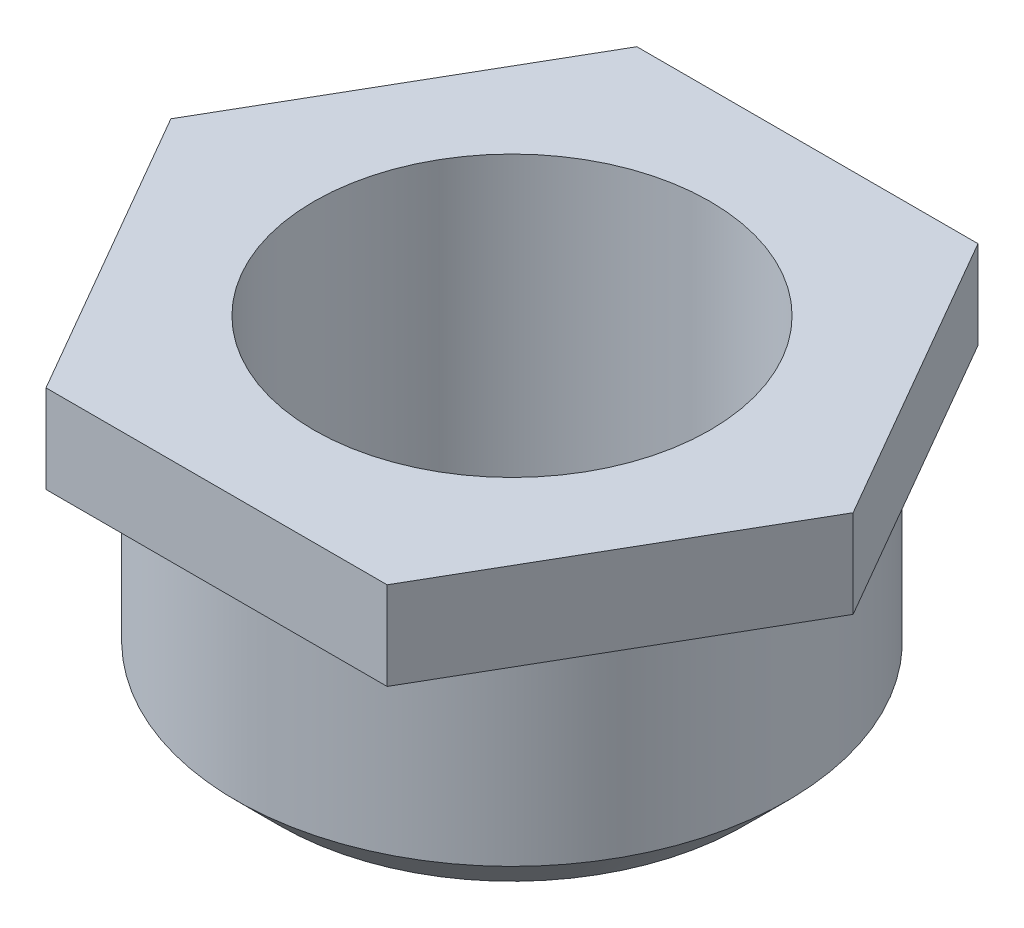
ISO-10303-21;
HEADER;
FILE_DESCRIPTION(('STEP AP214'),'2;1');
FILE_NAME('part.step','',(''),(''),'','','');
FILE_SCHEMA(('AUTOMOTIVE_DESIGN { 1 0 10303 214 1 1 1 1 }'));
ENDSEC;
DATA;
#1=APPLICATION_CONTEXT('core data for automotive mechanical design processes');
#2=APPLICATION_PROTOCOL_DEFINITION('international standard','automotive_design',2000,#1);
#3=PRODUCT_CONTEXT('',#1,'mechanical');
#4=PRODUCT('Part','Part','',(#3));
#5=PRODUCT_RELATED_PRODUCT_CATEGORY('part','',(#4));
#6=PRODUCT_DEFINITION_FORMATION('','',#4);
#7=PRODUCT_DEFINITION_CONTEXT('part definition',#1,'design');
#8=PRODUCT_DEFINITION('design','',#6,#7);
#9=PRODUCT_DEFINITION_SHAPE('','',#8);
#10=(LENGTH_UNIT() NAMED_UNIT(*) SI_UNIT(.MILLI.,.METRE.));
#11=(NAMED_UNIT(*) PLANE_ANGLE_UNIT() SI_UNIT($,.RADIAN.));
#12=(NAMED_UNIT(*) SI_UNIT($,.STERADIAN.) SOLID_ANGLE_UNIT());
#13=UNCERTAINTY_MEASURE_WITH_UNIT(LENGTH_MEASURE(1.E-05),#10,'distance_accuracy_value','');
#14=(GEOMETRIC_REPRESENTATION_CONTEXT(3) GLOBAL_UNCERTAINTY_ASSIGNED_CONTEXT((#13)) GLOBAL_UNIT_ASSIGNED_CONTEXT((#10,
#11,#12)) REPRESENTATION_CONTEXT('',''));
#15=CARTESIAN_POINT('',(0.,0.,0.));
#16=DIRECTION('',(0.,0.,1.));
#17=DIRECTION('',(1.,0.,0.));
#18=AXIS2_PLACEMENT_3D('',#15,#16,#17);
#19=CARTESIAN_POINT('',(6.271,5.4,0.));
#20=DIRECTION('',(0.,-1.,0.));
#21=DIRECTION('',(0.,0.,-1.));
#22=AXIS2_PLACEMENT_3D('',#19,#20,#21);
#23=PLANE('',#22);
#24=CARTESIAN_POINT('',(0.,5.4,0.));
#25=DIRECTION('',(0.,-1.,0.));
#26=DIRECTION('',(0.,0.,-1.));
#27=AXIS2_PLACEMENT_3D('',#24,#25,#26);
#28=CIRCLE('',#27,6.271);
#29=CARTESIAN_POINT('',(0.,5.4,-6.271));
#30=VERTEX_POINT('',#29);
#31=EDGE_CURVE('E142',#30,#30,#28,.T.);
#32=ORIENTED_EDGE('',*,*,#31,.F.);
#33=EDGE_LOOP('',(#32));
#34=FACE_BOUND('',#33,.T.);
#35=DIRECTION('',(0.5,0.,0.866025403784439));
#36=VECTOR('',#35,1.);
#37=CARTESIAN_POINT('',(7.38025,5.4,-0.640425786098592));
#38=LINE('',#37,#36);
#39=CARTESIAN_POINT('',(3.875,5.4,-6.7116968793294));
#40=VERTEX_POINT('',#39);
#41=CARTESIAN_POINT('',(7.75,5.4,0.));
#42=VERTEX_POINT('',#41);
#43=EDGE_CURVE('E119',#40,#42,#38,.T.);
#44=ORIENTED_EDGE('',*,*,#43,.T.);
#45=DIRECTION('',(-0.5,0.,0.866025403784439));
#46=VECTOR('',#45,1.);
#47=CARTESIAN_POINT('',(7.38025,5.4,0.640425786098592));
#48=LINE('',#47,#46);
#49=CARTESIAN_POINT('',(3.875,5.4,6.7116968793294));
#50=VERTEX_POINT('',#49);
#51=EDGE_CURVE('E136',#42,#50,#48,.T.);
#52=ORIENTED_EDGE('',*,*,#51,.T.);
#53=DIRECTION('',(-1.,0.,0.));
#54=VECTOR('',#53,1.);
#55=CARTESIAN_POINT('',(6.271,5.4,6.7116968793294));
#56=LINE('',#55,#54);
#57=CARTESIAN_POINT('',(-3.875,5.4,6.7116968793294));
#58=VERTEX_POINT('',#57);
#59=EDGE_CURVE('E133',#50,#58,#56,.T.);
#60=ORIENTED_EDGE('',*,*,#59,.T.);
#61=DIRECTION('',(-0.5,0.,-0.866025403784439));
#62=VECTOR('',#61,1.);
#63=CARTESIAN_POINT('',(-4.24475,5.4,6.07127109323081));
#64=LINE('',#63,#62);
#65=CARTESIAN_POINT('',(-7.75,5.4,0.));
#66=VERTEX_POINT('',#65);
#67=EDGE_CURVE('E130',#58,#66,#64,.T.);
#68=ORIENTED_EDGE('',*,*,#67,.T.);
#69=DIRECTION('',(0.5,0.,-0.866025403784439));
#70=VECTOR('',#69,1.);
#71=CARTESIAN_POINT('',(-4.24475,5.4,-6.07127109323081));
#72=LINE('',#71,#70);
#73=CARTESIAN_POINT('',(-3.875,5.4,-6.7116968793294));
#74=VERTEX_POINT('',#73);
#75=EDGE_CURVE('E128',#66,#74,#72,.T.);
#76=ORIENTED_EDGE('',*,*,#75,.T.);
#77=DIRECTION('',(1.,0.,0.));
#78=VECTOR('',#77,1.);
#79=CARTESIAN_POINT('',(6.271,5.4,-6.7116968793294));
#80=LINE('',#79,#78);
#81=EDGE_CURVE('E89',#74,#40,#80,.T.);
#82=ORIENTED_EDGE('',*,*,#81,.T.);
#83=EDGE_LOOP('',(#44,#52,#60,#68,#76,#82));
#84=FACE_BOUND('',#83,.T.);
#85=ADVANCED_FACE('F33',(#34,#84),#23,.T.);
#86=CARTESIAN_POINT('',(7.75,7.4,0.));
#87=DIRECTION('',(0.,1.,0.));
#88=DIRECTION('',(0.,0.,1.));
#89=AXIS2_PLACEMENT_3D('',#86,#87,#88);
#90=PLANE('',#89);
#91=CARTESIAN_POINT('',(0.,7.4,0.));
#92=DIRECTION('',(0.,-1.,0.));
#93=DIRECTION('',(0.,0.,-1.));
#94=AXIS2_PLACEMENT_3D('',#91,#92,#93);
#95=CIRCLE('',#94,4.5);
#96=CARTESIAN_POINT('',(0.,7.4,-4.5));
#97=VERTEX_POINT('',#96);
#98=EDGE_CURVE('E139',#97,#97,#95,.T.);
#99=ORIENTED_EDGE('',*,*,#98,.T.);
#100=EDGE_LOOP('',(#99));
#101=FACE_BOUND('',#100,.T.);
#102=DIRECTION('',(1.,0.,0.));
#103=VECTOR('',#102,1.);
#104=CARTESIAN_POINT('',(-3.875,7.4,6.7116968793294));
#105=LINE('',#104,#103);
#106=CARTESIAN_POINT('',(-3.875,7.4,6.7116968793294));
#107=VERTEX_POINT('',#106);
#108=CARTESIAN_POINT('',(3.875,7.4,6.7116968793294));
#109=VERTEX_POINT('',#108);
#110=EDGE_CURVE('E115',#107,#109,#105,.T.);
#111=ORIENTED_EDGE('',*,*,#110,.T.);
#112=DIRECTION('',(0.5,0.,-0.866025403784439));
#113=VECTOR('',#112,1.);
#114=CARTESIAN_POINT('',(3.875,7.4,6.7116968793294));
#115=LINE('',#114,#113);
#116=CARTESIAN_POINT('',(7.75,7.4,0.));
#117=VERTEX_POINT('',#116);
#118=EDGE_CURVE('E110',#109,#117,#115,.T.);
#119=ORIENTED_EDGE('',*,*,#118,.T.);
#120=DIRECTION('',(-0.5,0.,-0.866025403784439));
#121=VECTOR('',#120,1.);
#122=CARTESIAN_POINT('',(7.75,7.4,0.));
#123=LINE('',#122,#121);
#124=CARTESIAN_POINT('',(3.875,7.4,-6.7116968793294));
#125=VERTEX_POINT('',#124);
#126=EDGE_CURVE('E108',#117,#125,#123,.T.);
#127=ORIENTED_EDGE('',*,*,#126,.T.);
#128=DIRECTION('',(-1.,0.,0.));
#129=VECTOR('',#128,1.);
#130=CARTESIAN_POINT('',(3.875,7.4,-6.7116968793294));
#131=LINE('',#130,#129);
#132=CARTESIAN_POINT('',(-3.875,7.4,-6.7116968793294));
#133=VERTEX_POINT('',#132);
#134=EDGE_CURVE('E56',#125,#133,#131,.T.);
#135=ORIENTED_EDGE('',*,*,#134,.T.);
#136=DIRECTION('',(-0.5,0.,0.866025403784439));
#137=VECTOR('',#136,1.);
#138=CARTESIAN_POINT('',(-3.875,7.4,-6.7116968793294));
#139=LINE('',#138,#137);
#140=CARTESIAN_POINT('',(-7.75,7.4,0.));
#141=VERTEX_POINT('',#140);
#142=EDGE_CURVE('E96',#133,#141,#139,.T.);
#143=ORIENTED_EDGE('',*,*,#142,.T.);
#144=DIRECTION('',(0.5,0.,0.866025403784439));
#145=VECTOR('',#144,1.);
#146=CARTESIAN_POINT('',(-7.75,7.4,0.));
#147=LINE('',#146,#145);
#148=EDGE_CURVE('E102',#141,#107,#147,.T.);
#149=ORIENTED_EDGE('',*,*,#148,.T.);
#150=EDGE_LOOP('',(#111,#119,#127,#135,#143,#149));
#151=FACE_BOUND('',#150,.T.);
#152=ADVANCED_FACE('F106',(#101,#151),#90,.T.);
#153=CARTESIAN_POINT('',(0.,0.,0.));
#154=DIRECTION('',(0.,-1.,0.));
#155=DIRECTION('',(0.,0.,-1.));
#156=AXIS2_PLACEMENT_3D('',#153,#154,#155);
#157=CYLINDRICAL_SURFACE('',#156,4.5);
#158=CARTESIAN_POINT('',(0.,0.,0.));
#159=DIRECTION('',(0.,-1.,0.));
#160=DIRECTION('',(0.,0.,-1.));
#161=AXIS2_PLACEMENT_3D('',#158,#159,#160);
#162=CIRCLE('',#161,4.5);
#163=CARTESIAN_POINT('',(0.,0.,-4.5));
#164=VERTEX_POINT('',#163);
#165=EDGE_CURVE('E145',#164,#164,#162,.T.);
#166=ORIENTED_EDGE('',*,*,#165,.T.);
#167=EDGE_LOOP('',(#166));
#168=FACE_BOUND('',#167,.T.);
#169=ORIENTED_EDGE('',*,*,#98,.F.);
#170=EDGE_LOOP('',(#169));
#171=FACE_BOUND('',#170,.T.);
#172=ADVANCED_FACE('F167',(#168,#171),#157,.F.);
#173=CARTESIAN_POINT('',(4.5,0.,0.));
#174=DIRECTION('',(0.,-1.,0.));
#175=DIRECTION('',(0.,0.,-1.));
#176=AXIS2_PLACEMENT_3D('',#173,#174,#175);
#177=PLANE('',#176);
#178=CARTESIAN_POINT('',(0.,0.,0.));
#179=DIRECTION('',(0.,-1.,0.));
#180=DIRECTION('',(0.,0.,-1.));
#181=AXIS2_PLACEMENT_3D('',#178,#179,#180);
#182=CIRCLE('',#181,5.271);
#183=CARTESIAN_POINT('',(0.,0.,-5.271));
#184=VERTEX_POINT('',#183);
#185=EDGE_CURVE('E41',#184,#184,#182,.T.);
#186=ORIENTED_EDGE('',*,*,#185,.T.);
#187=EDGE_LOOP('',(#186));
#188=FACE_BOUND('',#187,.T.);
#189=ORIENTED_EDGE('',*,*,#165,.F.);
#190=EDGE_LOOP('',(#189));
#191=FACE_BOUND('',#190,.T.);
#192=ADVANCED_FACE('F150',(#188,#191),#177,.T.);
#193=CARTESIAN_POINT('',(0.,0.,0.));
#194=DIRECTION('',(0.,-1.,0.));
#195=DIRECTION('',(0.,0.,-1.));
#196=AXIS2_PLACEMENT_3D('',#193,#194,#195);
#197=CYLINDRICAL_SURFACE('',#196,6.271);
#198=CARTESIAN_POINT('',(0.,1.,0.));
#199=DIRECTION('',(0.,-1.,0.));
#200=DIRECTION('',(0.,0.,-1.));
#201=AXIS2_PLACEMENT_3D('',#198,#199,#200);
#202=CIRCLE('',#201,6.271);
#203=CARTESIAN_POINT('',(0.,1.,-6.271));
#204=VERTEX_POINT('',#203);
#205=EDGE_CURVE('E12',#204,#204,#202,.F.);
#206=ORIENTED_EDGE('',*,*,#205,.T.);
#207=EDGE_LOOP('',(#206));
#208=FACE_BOUND('',#207,.T.);
#209=ORIENTED_EDGE('',*,*,#31,.T.);
#210=EDGE_LOOP('',(#209));
#211=FACE_BOUND('',#210,.T.);
#212=ADVANCED_FACE('F174',(#208,#211),#197,.T.);
#213=CARTESIAN_POINT('',(3.875,-2.6,6.7116968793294));
#214=DIRECTION('',(0.866025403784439,0.,0.5));
#215=DIRECTION('',(0.5,0.,-0.866025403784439));
#216=AXIS2_PLACEMENT_3D('',#213,#214,#215);
#217=PLANE('',#216);
#218=DIRECTION('',(0.,1.,0.));
#219=VECTOR('',#218,1.);
#220=CARTESIAN_POINT('',(7.75,-2.6,0.));
#221=LINE('',#220,#219);
#222=EDGE_CURVE('E48',#42,#117,#221,.T.);
#223=ORIENTED_EDGE('',*,*,#222,.T.);
#224=ORIENTED_EDGE('',*,*,#118,.F.);
#225=DIRECTION('',(0.,1.,0.));
#226=VECTOR('',#225,1.);
#227=CARTESIAN_POINT('',(3.875,-2.6,6.7116968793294));
#228=LINE('',#227,#226);
#229=EDGE_CURVE('E117',#50,#109,#228,.T.);
#230=ORIENTED_EDGE('',*,*,#229,.F.);
#231=ORIENTED_EDGE('',*,*,#51,.F.);
#232=EDGE_LOOP('',(#223,#224,#230,#231));
#233=FACE_BOUND('',#232,.T.);
#234=ADVANCED_FACE('F177',(#233),#217,.T.);
#235=CARTESIAN_POINT('',(-3.875,-2.6,6.7116968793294));
#236=DIRECTION('',(0.,0.,1.));
#237=DIRECTION('',(1.,0.,0.));
#238=AXIS2_PLACEMENT_3D('',#235,#236,#237);
#239=PLANE('',#238);
#240=ORIENTED_EDGE('',*,*,#229,.T.);
#241=ORIENTED_EDGE('',*,*,#110,.F.);
#242=DIRECTION('',(0.,1.,0.));
#243=VECTOR('',#242,1.);
#244=CARTESIAN_POINT('',(-3.875,-2.6,6.7116968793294));
#245=LINE('',#244,#243);
#246=EDGE_CURVE('E120',#58,#107,#245,.T.);
#247=ORIENTED_EDGE('',*,*,#246,.F.);
#248=ORIENTED_EDGE('',*,*,#59,.F.);
#249=EDGE_LOOP('',(#240,#241,#247,#248));
#250=FACE_BOUND('',#249,.T.);
#251=ADVANCED_FACE('F204',(#250),#239,.T.);
#252=CARTESIAN_POINT('',(-7.75,-2.6,0.));
#253=DIRECTION('',(-0.866025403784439,0.,0.5));
#254=DIRECTION('',(0.5,0.,0.866025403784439));
#255=AXIS2_PLACEMENT_3D('',#252,#253,#254);
#256=PLANE('',#255);
#257=ORIENTED_EDGE('',*,*,#246,.T.);
#258=ORIENTED_EDGE('',*,*,#148,.F.);
#259=DIRECTION('',(0.,1.,0.));
#260=VECTOR('',#259,1.);
#261=CARTESIAN_POINT('',(-7.75,-2.6,0.));
#262=LINE('',#261,#260);
#263=EDGE_CURVE('E92',#66,#141,#262,.T.);
#264=ORIENTED_EDGE('',*,*,#263,.F.);
#265=ORIENTED_EDGE('',*,*,#67,.F.);
#266=EDGE_LOOP('',(#257,#258,#264,#265));
#267=FACE_BOUND('',#266,.T.);
#268=ADVANCED_FACE('F211',(#267),#256,.T.);
#269=CARTESIAN_POINT('',(-3.875,-2.6,-6.7116968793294));
#270=DIRECTION('',(-0.866025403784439,0.,-0.5));
#271=DIRECTION('',(-0.5,0.,0.866025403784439));
#272=AXIS2_PLACEMENT_3D('',#269,#270,#271);
#273=PLANE('',#272);
#274=ORIENTED_EDGE('',*,*,#263,.T.);
#275=ORIENTED_EDGE('',*,*,#142,.F.);
#276=DIRECTION('',(0.,1.,0.));
#277=VECTOR('',#276,1.);
#278=CARTESIAN_POINT('',(-3.875,-2.6,-6.7116968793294));
#279=LINE('',#278,#277);
#280=EDGE_CURVE('E85',#74,#133,#279,.T.);
#281=ORIENTED_EDGE('',*,*,#280,.F.);
#282=ORIENTED_EDGE('',*,*,#75,.F.);
#283=EDGE_LOOP('',(#274,#275,#281,#282));
#284=FACE_BOUND('',#283,.T.);
#285=ADVANCED_FACE('F97',(#284),#273,.T.);
#286=CARTESIAN_POINT('',(3.875,-2.6,-6.7116968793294));
#287=DIRECTION('',(0.,0.,-1.));
#288=DIRECTION('',(-1.,0.,0.));
#289=AXIS2_PLACEMENT_3D('',#286,#287,#288);
#290=PLANE('',#289);
#291=ORIENTED_EDGE('',*,*,#280,.T.);
#292=ORIENTED_EDGE('',*,*,#134,.F.);
#293=DIRECTION('',(0.,1.,0.));
#294=VECTOR('',#293,1.);
#295=CARTESIAN_POINT('',(3.875,-2.6,-6.7116968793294));
#296=LINE('',#295,#294);
#297=EDGE_CURVE('E93',#40,#125,#296,.T.);
#298=ORIENTED_EDGE('',*,*,#297,.F.);
#299=ORIENTED_EDGE('',*,*,#81,.F.);
#300=EDGE_LOOP('',(#291,#292,#298,#299));
#301=FACE_BOUND('',#300,.T.);
#302=ADVANCED_FACE('F87',(#301),#290,.T.);
#303=CARTESIAN_POINT('',(7.75,-2.6,0.));
#304=DIRECTION('',(0.866025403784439,0.,-0.5));
#305=DIRECTION('',(-0.5,0.,-0.866025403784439));
#306=AXIS2_PLACEMENT_3D('',#303,#304,#305);
#307=PLANE('',#306);
#308=ORIENTED_EDGE('',*,*,#297,.T.);
#309=ORIENTED_EDGE('',*,*,#126,.F.);
#310=ORIENTED_EDGE('',*,*,#222,.F.);
#311=ORIENTED_EDGE('',*,*,#43,.F.);
#312=EDGE_LOOP('',(#308,#309,#310,#311));
#313=FACE_BOUND('',#312,.T.);
#314=ADVANCED_FACE('F154',(#313),#307,.T.);
#315=CARTESIAN_POINT('',(0.,0.,0.));
#316=DIRECTION('',(0.,1.,0.));
#317=DIRECTION('',(0.,0.,1.));
#318=AXIS2_PLACEMENT_3D('',#315,#316,#317);
#319=CONICAL_SURFACE('',#318,5.271,0.785398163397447);
#320=ORIENTED_EDGE('',*,*,#205,.F.);
#321=EDGE_LOOP('',(#320));
#322=FACE_BOUND('',#321,.T.);
#323=ORIENTED_EDGE('',*,*,#185,.F.);
#324=EDGE_LOOP('',(#323));
#325=FACE_BOUND('',#324,.T.);
#326=ADVANCED_FACE('F35',(#322,#325),#319,.T.);
#327=CLOSED_SHELL('',(#85,#152,#172,#192,#212,#234,#251,#268,#285,#302,#314,#326));
#328=MANIFOLD_SOLID_BREP('B2',#327);
#329=ADVANCED_BREP_SHAPE_REPRESENTATION('',(#18,#328),#14);
#330=SHAPE_DEFINITION_REPRESENTATION(#9,#329);
ENDSEC;
END-ISO-10303-21;
